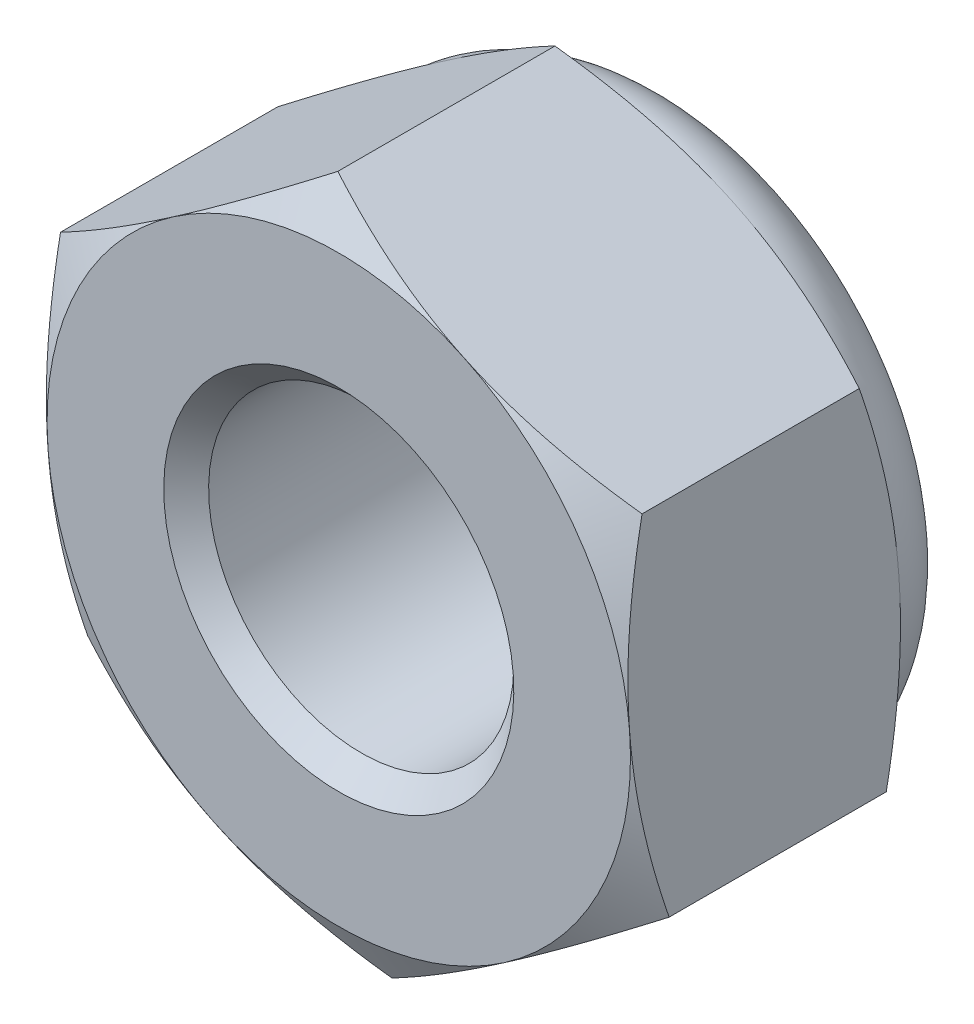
ISO-10303-21;
HEADER;
FILE_DESCRIPTION(('STEP AP214'),'2;1');
FILE_NAME('part.step','',(''),(''),'','','');
FILE_SCHEMA(('AUTOMOTIVE_DESIGN { 1 0 10303 214 1 1 1 1 }'));
ENDSEC;
DATA;
#1=APPLICATION_CONTEXT('core data for automotive mechanical design processes');
#2=APPLICATION_PROTOCOL_DEFINITION('international standard','automotive_design',2000,#1);
#3=PRODUCT_CONTEXT('',#1,'mechanical');
#4=PRODUCT('Part','Part','',(#3));
#5=PRODUCT_RELATED_PRODUCT_CATEGORY('part','',(#4));
#6=PRODUCT_DEFINITION_FORMATION('','',#4);
#7=PRODUCT_DEFINITION_CONTEXT('part definition',#1,'design');
#8=PRODUCT_DEFINITION('design','',#6,#7);
#9=PRODUCT_DEFINITION_SHAPE('','',#8);
#10=(LENGTH_UNIT() NAMED_UNIT(*) SI_UNIT(.MILLI.,.METRE.));
#11=(NAMED_UNIT(*) PLANE_ANGLE_UNIT() SI_UNIT($,.RADIAN.));
#12=(NAMED_UNIT(*) SI_UNIT($,.STERADIAN.) SOLID_ANGLE_UNIT());
#13=UNCERTAINTY_MEASURE_WITH_UNIT(LENGTH_MEASURE(1.E-05),#10,'distance_accuracy_value','');
#14=(GEOMETRIC_REPRESENTATION_CONTEXT(3) GLOBAL_UNCERTAINTY_ASSIGNED_CONTEXT((#13)) GLOBAL_UNIT_ASSIGNED_CONTEXT((#10,
#11,#12)) REPRESENTATION_CONTEXT('',''));
#15=CARTESIAN_POINT('',(0.,0.,0.));
#16=DIRECTION('',(0.,0.,1.));
#17=DIRECTION('',(1.,0.,0.));
#18=AXIS2_PLACEMENT_3D('',#15,#16,#17);
#19=CARTESIAN_POINT('',(725.474859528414,-0.667794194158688,-43.5));
#20=DIRECTION('',(-0.567885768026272,0.823107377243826,0.));
#21=DIRECTION('',(-0.823107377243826,-0.567885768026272,0.));
#22=AXIS2_PLACEMENT_3D('',#19,#20,#21);
#23=PLANE('',#22);
#24=DIRECTION('',(0.,0.,1.));
#25=VECTOR('',#24,1.);
#26=CARTESIAN_POINT('',(719.296983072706,-4.93009120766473,-43.5));
#27=LINE('',#26,#25);
#28=CARTESIAN_POINT('',(719.296983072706,-4.93009120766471,-42.9194434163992));
#29=VERTEX_POINT('',#28);
#30=CARTESIAN_POINT('',(719.296983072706,-4.93009120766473,-38.0805565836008));
#31=VERTEX_POINT('',#30);
#32=EDGE_CURVE('E175',#29,#31,#27,.T.);
#33=ORIENTED_EDGE('',*,*,#32,.T.);
#34=CARTESIAN_POINT('',(719.2967929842,-4.93022235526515,-38.0806232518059));
#35=CARTESIAN_POINT('',(719.432589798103,-4.8365321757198,-38.0330044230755));
#36=CARTESIAN_POINT('',(719.568892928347,-4.74249267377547,-37.9875467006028));
#37=CARTESIAN_POINT('',(719.842606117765,-4.55364996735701,-37.9015486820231));
#38=CARTESIAN_POINT('',(719.9800166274,-4.45884645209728,-37.8610105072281));
#39=CARTESIAN_POINT('',(720.394448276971,-4.17291797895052,-37.7475710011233));
#40=CARTESIAN_POINT('',(720.673105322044,-3.9806643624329,-37.6830478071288));
#41=CARTESIAN_POINT('',(721.090110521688,-3.69296032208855,-37.6073865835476));
#42=CARTESIAN_POINT('',(721.227212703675,-3.59836953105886,-37.5858328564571));
#43=CARTESIAN_POINT('',(721.502036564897,-3.4087605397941,-37.5496903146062));
#44=CARTESIAN_POINT('',(721.639758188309,-3.31374237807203,-37.5351008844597));
#45=CARTESIAN_POINT('',(721.915440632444,-3.12354102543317,-37.5132587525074));
#46=CARTESIAN_POINT('',(722.053401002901,-3.02835814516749,-37.5059977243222));
#47=CARTESIAN_POINT('',(722.329441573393,-2.83790971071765,-37.4989603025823));
#48=CARTESIAN_POINT('',(722.467521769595,-2.74264415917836,-37.4991836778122));
#49=CARTESIAN_POINT('',(722.845817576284,-2.48164685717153,-37.5100834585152));
#50=CARTESIAN_POINT('',(723.085909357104,-2.31600054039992,-37.5283818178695));
#51=CARTESIAN_POINT('',(723.564498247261,-1.9858081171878,-37.5864063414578));
#52=CARTESIAN_POINT('',(723.80299367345,-1.82126317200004,-37.6261523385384));
#53=CARTESIAN_POINT('',(724.282545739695,-1.49040622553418,-37.7255059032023));
#54=CARTESIAN_POINT('',(724.523541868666,-1.32413597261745,-37.7855344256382));
#55=CARTESIAN_POINT('',(725.001940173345,-0.994075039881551,-37.92177499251));
#56=CARTESIAN_POINT('',(725.239348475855,-0.830280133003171,-37.9979550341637));
#57=CARTESIAN_POINT('',(725.475049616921,-0.667663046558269,-38.0806232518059));
#58=B_SPLINE_CURVE_WITH_KNOTS('',3,(#34,#35,#36,#37,#38,#39,#40,#41,#42,#43,#44,#45,#46,#47,#48,
#49,#50,#51,#52,#53,#54,#55,#56,#57),.UNSPECIFIED.,.F.,.F.,(4,2,2,2,2,2,2,2,2,2,2,4),(0.,
0.51510505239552,1.03043143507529,2.06322554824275,2.56697389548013,3.07067772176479,
3.57380860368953,4.07692394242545,4.95279354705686,5.82947446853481,6.72559912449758,
7.61996451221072),.UNSPECIFIED.);
#59=CARTESIAN_POINT('',(722.38592130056,-2.79894270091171,-37.5));
#60=VERTEX_POINT('',#59);
#61=EDGE_CURVE('E39',#31,#60,#58,.T.);
#62=ORIENTED_EDGE('',*,*,#61,.T.);
#63=CARTESIAN_POINT('',(725.474859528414,-0.667794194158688,-38.0805565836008));
#64=VERTEX_POINT('',#63);
#65=EDGE_CURVE('E273',#60,#64,#58,.T.);
#66=ORIENTED_EDGE('',*,*,#65,.T.);
#67=DIRECTION('',(0.,0.,1.));
#68=VECTOR('',#67,1.);
#69=CARTESIAN_POINT('',(725.474859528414,-0.667794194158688,-43.5));
#70=LINE('',#69,#68);
#71=CARTESIAN_POINT('',(725.474859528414,-0.667794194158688,-42.9194434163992));
#72=VERTEX_POINT('',#71);
#73=EDGE_CURVE('E149',#72,#64,#70,.T.);
#74=ORIENTED_EDGE('',*,*,#73,.F.);
#75=CARTESIAN_POINT('',(719.2967929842,-4.93022235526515,-42.9193767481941));
#76=CARTESIAN_POINT('',(719.432589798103,-4.83653217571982,-42.9669955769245));
#77=CARTESIAN_POINT('',(719.568892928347,-4.74249267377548,-43.0124532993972));
#78=CARTESIAN_POINT('',(719.842606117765,-4.553649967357,-43.0984513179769));
#79=CARTESIAN_POINT('',(719.9800166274,-4.45884645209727,-43.1389894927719));
#80=CARTESIAN_POINT('',(720.394448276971,-4.1729179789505,-43.2524289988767));
#81=CARTESIAN_POINT('',(720.673105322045,-3.98066436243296,-43.3169521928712));
#82=CARTESIAN_POINT('',(721.090110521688,-3.69296032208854,-43.3926134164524));
#83=CARTESIAN_POINT('',(721.227212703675,-3.59836953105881,-43.4141671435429));
#84=CARTESIAN_POINT('',(721.502036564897,-3.40876053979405,-43.4503096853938));
#85=CARTESIAN_POINT('',(721.639758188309,-3.31374237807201,-43.4648991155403));
#86=CARTESIAN_POINT('',(721.915440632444,-3.12354102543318,-43.4867412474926));
#87=CARTESIAN_POINT('',(722.053401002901,-3.02835814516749,-43.4940022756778));
#88=CARTESIAN_POINT('',(722.329441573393,-2.83790971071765,-43.5010396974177));
#89=CARTESIAN_POINT('',(722.467521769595,-2.74264415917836,-43.5008163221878));
#90=CARTESIAN_POINT('',(722.845817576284,-2.48164685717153,-43.4899165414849));
#91=CARTESIAN_POINT('',(723.085909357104,-2.31600054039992,-43.4716181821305));
#92=CARTESIAN_POINT('',(723.564498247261,-1.9858081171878,-43.4135936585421));
#93=CARTESIAN_POINT('',(723.80299367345,-1.82126317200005,-43.3738476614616));
#94=CARTESIAN_POINT('',(724.282545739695,-1.49040622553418,-43.2744940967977));
#95=CARTESIAN_POINT('',(724.523541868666,-1.32413597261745,-43.2144655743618));
#96=CARTESIAN_POINT('',(725.001940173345,-0.994075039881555,-43.07822500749));
#97=CARTESIAN_POINT('',(725.239348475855,-0.830280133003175,-43.0020449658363));
#98=CARTESIAN_POINT('',(725.475049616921,-0.667663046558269,-42.9193767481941));
#99=B_SPLINE_CURVE_WITH_KNOTS('',3,(#75,#76,#77,#78,#79,#80,#81,#82,#83,#84,#85,#86,#87,#88,#89,
#90,#91,#92,#93,#94,#95,#96,#97,#98),.UNSPECIFIED.,.F.,.F.,(4,2,2,2,2,2,2,2,2,2,2,4),(0.,
0.515105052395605,1.03043143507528,2.06322554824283,2.56697389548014,3.07067772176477,
3.57380860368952,4.07692394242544,4.95279354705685,5.8294744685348,6.72559912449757,
7.61996451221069),.UNSPECIFIED.);
#100=CARTESIAN_POINT('',(722.38592130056,-2.79894270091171,-43.5));
#101=VERTEX_POINT('',#100);
#102=EDGE_CURVE('E177',#101,#72,#99,.T.);
#103=ORIENTED_EDGE('',*,*,#102,.F.);
#104=EDGE_CURVE('E182',#29,#101,#99,.T.);
#105=ORIENTED_EDGE('',*,*,#104,.F.);
#106=EDGE_LOOP('',(#33,#62,#66,#74,#103,#105));
#107=FACE_BOUND('',#106,.T.);
#108=ADVANCED_FACE('F16',(#107),#23,.T.);
#109=CARTESIAN_POINT('',(732.255055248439,-3.88684363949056,-43.5));
#110=DIRECTION('',(0.428889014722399,0.903357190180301,0.));
#111=DIRECTION('',(-0.903357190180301,0.428889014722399,0.));
#112=AXIS2_PLACEMENT_3D('',#109,#110,#111);
#113=PLANE('',#112);
#114=ORIENTED_EDGE('',*,*,#73,.T.);
#115=CARTESIAN_POINT('',(725.474650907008,-0.667695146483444,-38.0806232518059));
#116=CARTESIAN_POINT('',(725.623687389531,-0.738453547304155,-38.0330044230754));
#117=CARTESIAN_POINT('',(725.773279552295,-0.8094757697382,-37.9875467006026));
#118=CARTESIAN_POINT('',(726.073678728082,-0.952096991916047,-37.901548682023));
#119=CARTESIAN_POINT('',(726.224486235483,-1.023696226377,-37.861010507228));
#120=CARTESIAN_POINT('',(726.679323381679,-1.23964032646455,-37.7475710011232));
#121=CARTESIAN_POINT('',(726.985148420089,-1.3848375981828,-37.6830478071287));
#122=CARTESIAN_POINT('',(727.44281002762,-1.60212267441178,-37.6073865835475));
#123=CARTESIAN_POINT('',(727.59327914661,-1.67356125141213,-37.585832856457));
#124=CARTESIAN_POINT('',(727.894897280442,-1.81676120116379,-37.5496903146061));
#125=CARTESIAN_POINT('',(728.04604623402,-1.88852254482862,-37.5351008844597));
#126=CARTESIAN_POINT('',(728.348606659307,-2.03216986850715,-37.5132587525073));
#127=CARTESIAN_POINT('',(728.50001763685,-2.10405561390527,-37.5059977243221));
#128=CARTESIAN_POINT('',(728.802971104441,-2.24788954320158,-37.4989603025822));
#129=CARTESIAN_POINT('',(728.954513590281,-2.31983772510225,-37.4991836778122));
#130=CARTESIAN_POINT('',(729.369691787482,-2.51695285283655,-37.5100834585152));
#131=CARTESIAN_POINT('',(729.63319159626,-2.64205527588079,-37.5283818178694));
#132=CARTESIAN_POINT('',(730.158441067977,-2.89142920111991,-37.5864063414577));
#133=CARTESIAN_POINT('',(730.420188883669,-3.01569982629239,-37.6261523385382));
#134=CARTESIAN_POINT('',(730.946495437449,-3.26557562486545,-37.7255059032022));
#135=CARTESIAN_POINT('',(731.210987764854,-3.39114926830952,-37.785534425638));
#136=CARTESIAN_POINT('',(731.73602806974,-3.64042388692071,-37.9217749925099));
#137=CARTESIAN_POINT('',(731.996582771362,-3.76412805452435,-37.9979550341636));
#138=CARTESIAN_POINT('',(732.255263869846,-3.8869426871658,-38.0806232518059));
#139=B_SPLINE_CURVE_WITH_KNOTS('',3,(#115,#116,#117,#118,#119,#120,#121,#122,#123,#124,#125,
#126,#127,#128,#129,#130,#131,#132,#133,#134,#135,#136,#137,#138),.UNSPECIFIED.,.F.,.F.,(4,2,2,
2,2,2,2,2,2,2,2,4),(0.,0.515105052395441,1.03043143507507,2.0632255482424,2.56697389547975,
3.0706777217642,3.57380860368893,4.07692394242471,4.95279354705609,5.82947446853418,
6.72559912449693,7.61996451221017),.UNSPECIFIED.);
#140=CARTESIAN_POINT('',(728.864957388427,-2.27731891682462,-37.5));
#141=VERTEX_POINT('',#140);
#142=EDGE_CURVE('E279',#64,#141,#139,.T.);
#143=ORIENTED_EDGE('',*,*,#142,.T.);
#144=CARTESIAN_POINT('',(732.255055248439,-3.88684363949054,-38.0805565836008));
#145=VERTEX_POINT('',#144);
#146=EDGE_CURVE('E274',#141,#145,#139,.T.);
#147=ORIENTED_EDGE('',*,*,#146,.T.);
#148=DIRECTION('',(0.,0.,1.));
#149=VECTOR('',#148,1.);
#150=CARTESIAN_POINT('',(732.255055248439,-3.88684363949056,-43.5));
#151=LINE('',#150,#149);
#152=CARTESIAN_POINT('',(732.255055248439,-3.88684363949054,-42.9194434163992));
#153=VERTEX_POINT('',#152);
#154=EDGE_CURVE('E153',#153,#145,#151,.T.);
#155=ORIENTED_EDGE('',*,*,#154,.F.);
#156=CARTESIAN_POINT('',(725.474650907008,-0.667695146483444,-42.9193767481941));
#157=CARTESIAN_POINT('',(725.623687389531,-0.738453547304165,-42.9669955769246));
#158=CARTESIAN_POINT('',(725.773279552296,-0.809475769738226,-43.0124532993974));
#159=CARTESIAN_POINT('',(726.073678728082,-0.952096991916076,-43.0984513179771));
#160=CARTESIAN_POINT('',(726.224486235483,-1.02369622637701,-43.138989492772));
#161=CARTESIAN_POINT('',(726.679323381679,-1.23964032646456,-43.2524289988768));
#162=CARTESIAN_POINT('',(726.985148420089,-1.38483759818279,-43.3169521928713));
#163=CARTESIAN_POINT('',(727.44281002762,-1.60212267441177,-43.3926134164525));
#164=CARTESIAN_POINT('',(727.59327914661,-1.6735612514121,-43.414167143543));
#165=CARTESIAN_POINT('',(727.894897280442,-1.81676120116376,-43.4503096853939));
#166=CARTESIAN_POINT('',(728.04604623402,-1.8885225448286,-43.4648991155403));
#167=CARTESIAN_POINT('',(728.348606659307,-2.03216986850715,-43.4867412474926));
#168=CARTESIAN_POINT('',(728.50001763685,-2.10405561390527,-43.4940022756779));
#169=CARTESIAN_POINT('',(728.802971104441,-2.24788954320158,-43.5010396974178));
#170=CARTESIAN_POINT('',(728.954513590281,-2.31983772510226,-43.5008163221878));
#171=CARTESIAN_POINT('',(729.369691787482,-2.51695285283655,-43.4899165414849));
#172=CARTESIAN_POINT('',(729.63319159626,-2.64205527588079,-43.4716181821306));
#173=CARTESIAN_POINT('',(730.158441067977,-2.89142920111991,-43.4135936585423));
#174=CARTESIAN_POINT('',(730.420188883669,-3.01569982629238,-43.3738476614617));
#175=CARTESIAN_POINT('',(730.946495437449,-3.26557562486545,-43.2744940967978));
#176=CARTESIAN_POINT('',(731.210987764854,-3.39114926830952,-43.214465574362));
#177=CARTESIAN_POINT('',(731.73602806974,-3.64042388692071,-43.0782250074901));
#178=CARTESIAN_POINT('',(731.996582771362,-3.76412805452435,-43.0020449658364));
#179=CARTESIAN_POINT('',(732.255263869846,-3.8869426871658,-42.9193767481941));
#180=B_SPLINE_CURVE_WITH_KNOTS('',3,(#156,#157,#158,#159,#160,#161,#162,#163,#164,#165,#166,
#167,#168,#169,#170,#171,#172,#173,#174,#175,#176,#177,#178,#179),.UNSPECIFIED.,.F.,.F.,(4,2,2,
2,2,2,2,2,2,2,2,4),(0.,0.515105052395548,1.03043143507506,2.06322554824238,2.56697389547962,
3.07067772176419,3.57380860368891,4.0769239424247,4.95279354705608,5.82947446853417,
6.72559912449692,7.61996451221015),.UNSPECIFIED.);
#181=CARTESIAN_POINT('',(728.864957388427,-2.27731891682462,-43.5));
#182=VERTEX_POINT('',#181);
#183=EDGE_CURVE('E163',#182,#153,#180,.T.);
#184=ORIENTED_EDGE('',*,*,#183,.F.);
#185=EDGE_CURVE('E181',#72,#182,#180,.T.);
#186=ORIENTED_EDGE('',*,*,#185,.F.);
#187=EDGE_LOOP('',(#114,#143,#147,#155,#184,#186));
#188=FACE_BOUND('',#187,.T.);
#189=ADVANCED_FACE('F280',(#188),#113,.T.);
#190=CARTESIAN_POINT('',(732.255055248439,-3.88684363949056,-43.5));
#191=DIRECTION('',(-0.996774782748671,-0.0802498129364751,0.));
#192=DIRECTION('',(0.,0.,1.));
#193=AXIS2_PLACEMENT_3D('',#190,#191,#192);
#194=PLANE('',#193);
#195=CARTESIAN_POINT('',(733.35493460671,-17.5483335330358,-40.610423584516));
#196=CARTESIAN_POINT('',(733.332032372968,-17.2638672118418,-40.4725089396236));
#197=CARTESIAN_POINT('',(733.309075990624,-16.978728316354,-40.3359652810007));
#198=CARTESIAN_POINT('',(733.263025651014,-16.4067417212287,-40.0664033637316));
#199=CARTESIAN_POINT('',(733.239931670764,-16.1198937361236,-39.9333857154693));
#200=CARTESIAN_POINT('',(733.193452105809,-15.5425757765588,-39.6709585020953));
#201=CARTESIAN_POINT('',(733.170065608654,-15.2520944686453,-39.5415739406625));
#202=CARTESIAN_POINT('',(733.123100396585,-14.6687443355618,-39.2883622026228));
#203=CARTESIAN_POINT('',(733.099521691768,-14.3758756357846,-39.1645347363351));
#204=CARTESIAN_POINT('',(733.051841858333,-13.7836492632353,-38.9224448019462));
#205=CARTESIAN_POINT('',(733.027737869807,-13.4842560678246,-38.8042693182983));
#206=CARTESIAN_POINT('',(732.979245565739,-12.8819380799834,-38.5771738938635));
#207=CARTESIAN_POINT('',(732.954857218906,-12.5790128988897,-38.468254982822));
#208=CARTESIAN_POINT('',(732.905807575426,-11.9697722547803,-38.262599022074));
#209=CARTESIAN_POINT('',(732.881146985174,-11.6634655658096,-38.1658360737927));
#210=CARTESIAN_POINT('',(732.831474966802,-11.0464944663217,-37.9876357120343));
#211=CARTESIAN_POINT('',(732.806463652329,-10.7358314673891,-37.9061934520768));
#212=CARTESIAN_POINT('',(732.756074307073,-10.1099505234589,-37.7625840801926));
#213=CARTESIAN_POINT('',(732.730696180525,-9.79473138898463,-37.7004221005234));
#214=CARTESIAN_POINT('',(732.679630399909,-9.1604485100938,-37.599574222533));
#215=CARTESIAN_POINT('',(732.653942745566,-8.84138476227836,-37.5608883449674));
#216=CARTESIAN_POINT('',(732.615370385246,-8.36228138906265,-37.522946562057));
#217=CARTESIAN_POINT('',(732.602546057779,-8.20299171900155,-37.5136452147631));
#218=CARTESIAN_POINT('',(732.576876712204,-7.88415538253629,-37.5018140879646));
#219=CARTESIAN_POINT('',(732.564031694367,-7.72460871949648,-37.4992842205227));
#220=CARTESIAN_POINT('',(732.538348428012,-7.40559947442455,-37.5010640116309));
#221=CARTESIAN_POINT('',(732.525510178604,-7.24613688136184,-37.505371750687));
#222=CARTESIAN_POINT('',(732.499859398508,-6.927531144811,-37.5207175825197));
#223=CARTESIAN_POINT('',(732.487046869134,-6.76838801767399,-37.5317560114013));
#224=CARTESIAN_POINT('',(732.45599325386,-6.38267421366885,-37.566436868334));
#225=CARTESIAN_POINT('',(732.43777603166,-6.15639994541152,-37.5934518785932));
#226=CARTESIAN_POINT('',(732.401481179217,-5.70558526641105,-37.659589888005));
#227=CARTESIAN_POINT('',(732.383403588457,-5.48104534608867,-37.6987161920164));
#228=CARTESIAN_POINT('',(732.347402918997,-5.0338846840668,-37.7876891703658));
#229=CARTESIAN_POINT('',(732.32948000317,-4.81126596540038,-37.8375459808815));
#230=CARTESIAN_POINT('',(732.293818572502,-4.36831895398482,-37.9464587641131));
#231=CARTESIAN_POINT('',(732.276080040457,-4.14799044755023,-38.0055138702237));
#232=CARTESIAN_POINT('',(732.240350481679,-3.70419722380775,-38.1329541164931));
#233=CARTESIAN_POINT('',(732.222363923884,-3.48078801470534,-38.2015324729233));
#234=CARTESIAN_POINT('',(732.186580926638,-3.03633103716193,-38.3454651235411));
#235=CARTESIAN_POINT('',(732.168784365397,-2.81528175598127,-38.4208147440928));
#236=CARTESIAN_POINT('',(732.133452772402,-2.37643162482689,-38.5767335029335));
#237=CARTESIAN_POINT('',(732.115916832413,-2.15861949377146,-38.6572708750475));
#238=CARTESIAN_POINT('',(732.080981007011,-1.72468515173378,-38.8230727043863));
#239=CARTESIAN_POINT('',(732.063581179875,-1.50856366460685,-38.9083390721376));
#240=CARTESIAN_POINT('',(732.046244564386,-1.29322732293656,-38.9955021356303));
#241=B_SPLINE_CURVE_WITH_KNOTS('',3,(#195,#196,#197,#198,#199,#200,#201,#202,#203,#204,#205,
#206,#207,#208,#209,#210,#211,#212,#213,#214,#215,#216,#217,#218,#219,#220,#221,#222,#223,#224,
#225,#226,#227,#228,#229,#230,#231,#232,#233,#234,#235,#236,#237,#238,#239,#240),.UNSPECIFIED.,
.F.,.F.,(4,2,2,2,2,2,2,2,2,2,2,2,2,2,2,2,2,2,2,2,2,2,4),(0.,0.950904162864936,1.90197187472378,
2.85848216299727,3.81494253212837,4.78314526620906,5.75145556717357,6.71766655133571,
7.68357137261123,8.64973308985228,9.61589566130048,10.0960003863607,10.5760988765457,
11.0560626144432,11.5360503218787,12.2214931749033,12.9071232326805,13.59340381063,
14.2796197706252,14.982656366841,15.6852113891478,16.3838119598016,17.0826968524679),.UNSPECIFIED.);
#242=CARTESIAN_POINT('',(732.857374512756,-11.3681900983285,-38.0805565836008));
#243=VERTEX_POINT('',#242);
#244=CARTESIAN_POINT('',(732.556214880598,-7.62751686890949,-37.5));
#245=VERTEX_POINT('',#244);
#246=EDGE_CURVE('E263',#243,#245,#241,.T.);
#247=ORIENTED_EDGE('',*,*,#246,.F.);
#248=DIRECTION('',(0.,0.,1.));
#249=VECTOR('',#248,1.);
#250=CARTESIAN_POINT('',(732.857374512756,-11.3681900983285,-43.5));
#251=LINE('',#250,#249);
#252=CARTESIAN_POINT('',(732.857374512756,-11.3681900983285,-42.9194434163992));
#253=VERTEX_POINT('',#252);
#254=EDGE_CURVE('E160',#253,#243,#251,.T.);
#255=ORIENTED_EDGE('',*,*,#254,.F.);
#256=CARTESIAN_POINT('',(733.35493460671,-17.5483335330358,-40.389576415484));
#257=CARTESIAN_POINT('',(733.332032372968,-17.2638672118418,-40.5274910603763));
#258=CARTESIAN_POINT('',(733.309075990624,-16.978728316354,-40.6640347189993));
#259=CARTESIAN_POINT('',(733.263025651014,-16.4067417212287,-40.9335966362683));
#260=CARTESIAN_POINT('',(733.239931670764,-16.1198937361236,-41.0666142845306));
#261=CARTESIAN_POINT('',(733.193452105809,-15.5425757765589,-41.3290414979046));
#262=CARTESIAN_POINT('',(733.170065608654,-15.2520944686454,-41.4584260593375));
#263=CARTESIAN_POINT('',(733.123100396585,-14.6687443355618,-41.7116377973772));
#264=CARTESIAN_POINT('',(733.099521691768,-14.3758756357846,-41.8354652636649));
#265=CARTESIAN_POINT('',(733.051841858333,-13.7836492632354,-42.0775551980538));
#266=CARTESIAN_POINT('',(733.027737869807,-13.4842560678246,-42.1957306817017));
#267=CARTESIAN_POINT('',(732.979245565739,-12.8819380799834,-42.4228261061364));
#268=CARTESIAN_POINT('',(732.954857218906,-12.5790128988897,-42.531745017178));
#269=CARTESIAN_POINT('',(732.905807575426,-11.9697722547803,-42.737400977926));
#270=CARTESIAN_POINT('',(732.881146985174,-11.6634655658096,-42.8341639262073));
#271=CARTESIAN_POINT('',(732.831474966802,-11.0464944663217,-43.0123642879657));
#272=CARTESIAN_POINT('',(732.806463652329,-10.7358314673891,-43.0938065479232));
#273=CARTESIAN_POINT('',(732.756074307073,-10.1099505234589,-43.2374159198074));
#274=CARTESIAN_POINT('',(732.730696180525,-9.79473138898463,-43.2995778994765));
#275=CARTESIAN_POINT('',(732.679630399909,-9.1604485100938,-43.400425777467));
#276=CARTESIAN_POINT('',(732.653942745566,-8.84138476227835,-43.4391116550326));
#277=CARTESIAN_POINT('',(732.615370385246,-8.36228138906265,-43.477053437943));
#278=CARTESIAN_POINT('',(732.602546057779,-8.20299171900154,-43.4863547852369));
#279=CARTESIAN_POINT('',(732.576876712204,-7.88415538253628,-43.4981859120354));
#280=CARTESIAN_POINT('',(732.564031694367,-7.72460871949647,-43.5007157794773));
#281=CARTESIAN_POINT('',(732.538348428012,-7.40559947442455,-43.4989359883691));
#282=CARTESIAN_POINT('',(732.525510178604,-7.24613688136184,-43.494628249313));
#283=CARTESIAN_POINT('',(732.499859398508,-6.927531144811,-43.4792824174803));
#284=CARTESIAN_POINT('',(732.487046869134,-6.76838801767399,-43.4682439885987));
#285=CARTESIAN_POINT('',(732.45599325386,-6.38267421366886,-43.4335631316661));
#286=CARTESIAN_POINT('',(732.437776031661,-6.15639994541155,-43.4065481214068));
#287=CARTESIAN_POINT('',(732.401481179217,-5.70558526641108,-43.3404101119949));
#288=CARTESIAN_POINT('',(732.383403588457,-5.4810453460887,-43.3012838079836));
#289=CARTESIAN_POINT('',(732.347402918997,-5.03388468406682,-43.2123108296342));
#290=CARTESIAN_POINT('',(732.32948000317,-4.8112659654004,-43.1624540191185));
#291=CARTESIAN_POINT('',(732.293818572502,-4.36831895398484,-43.0535412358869));
#292=CARTESIAN_POINT('',(732.276080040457,-4.14799044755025,-42.9944861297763));
#293=CARTESIAN_POINT('',(732.240350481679,-3.70419722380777,-42.8670458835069));
#294=CARTESIAN_POINT('',(732.222363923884,-3.48078801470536,-42.7984675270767));
#295=CARTESIAN_POINT('',(732.186580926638,-3.03633103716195,-42.6545348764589));
#296=CARTESIAN_POINT('',(732.168784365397,-2.81528175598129,-42.5791852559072));
#297=CARTESIAN_POINT('',(732.133452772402,-2.3764316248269,-42.4232664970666));
#298=CARTESIAN_POINT('',(732.115916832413,-2.15861949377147,-42.3427291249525));
#299=CARTESIAN_POINT('',(732.080981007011,-1.72468515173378,-42.1769272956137));
#300=CARTESIAN_POINT('',(732.063581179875,-1.50856366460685,-42.0916609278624));
#301=CARTESIAN_POINT('',(732.046244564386,-1.29322732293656,-42.0044978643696));
#302=B_SPLINE_CURVE_WITH_KNOTS('',3,(#256,#257,#258,#259,#260,#261,#262,#263,#264,#265,#266,
#267,#268,#269,#270,#271,#272,#273,#274,#275,#276,#277,#278,#279,#280,#281,#282,#283,#284,#285,
#286,#287,#288,#289,#290,#291,#292,#293,#294,#295,#296,#297,#298,#299,#300,#301),.UNSPECIFIED.,
.F.,.F.,(4,2,2,2,2,2,2,2,2,2,2,2,2,2,2,2,2,2,2,2,2,2,4),(0.,0.950904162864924,1.90197187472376,
2.85848216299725,3.81494253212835,4.78314526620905,5.75145556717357,6.71766655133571,
7.68357137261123,8.64973308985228,9.61589566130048,10.0960003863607,10.5760988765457,
11.0560626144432,11.5360503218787,12.2214931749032,12.9071232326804,13.59340381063,
14.2796197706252,14.982656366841,15.6852113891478,16.3838119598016,17.0826968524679),.UNSPECIFIED.);
#303=CARTESIAN_POINT('',(732.556214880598,-7.62751686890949,-43.5));
#304=VERTEX_POINT('',#303);
#305=EDGE_CURVE('E134',#253,#304,#302,.T.);
#306=ORIENTED_EDGE('',*,*,#305,.T.);
#307=EDGE_CURVE('E189',#304,#153,#302,.T.);
#308=ORIENTED_EDGE('',*,*,#307,.T.);
#309=ORIENTED_EDGE('',*,*,#154,.T.);
#310=EDGE_CURVE('E268',#245,#145,#241,.T.);
#311=ORIENTED_EDGE('',*,*,#310,.F.);
#312=EDGE_LOOP('',(#247,#255,#306,#308,#309,#311));
#313=FACE_BOUND('',#312,.T.);
#314=ADVANCED_FACE('F202',(#313),#194,.F.);
#315=CARTESIAN_POINT('',(726.679498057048,-15.6304871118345,-43.5));
#316=DIRECTION('',(0.567885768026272,-0.823107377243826,0.));
#317=DIRECTION('',(0.823107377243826,0.567885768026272,0.));
#318=AXIS2_PLACEMENT_3D('',#315,#316,#317);
#319=PLANE('',#318);
#320=ORIENTED_EDGE('',*,*,#254,.T.);
#321=CARTESIAN_POINT('',(732.857564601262,-11.368058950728,-38.0806232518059));
#322=CARTESIAN_POINT('',(732.721767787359,-11.4617491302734,-38.0330044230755));
#323=CARTESIAN_POINT('',(732.585464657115,-11.5557886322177,-37.9875467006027));
#324=CARTESIAN_POINT('',(732.311751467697,-11.7446313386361,-37.9015486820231));
#325=CARTESIAN_POINT('',(732.174340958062,-11.8394348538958,-37.8610105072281));
#326=CARTESIAN_POINT('',(731.759909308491,-12.1253633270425,-37.7475710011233));
#327=CARTESIAN_POINT('',(731.481252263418,-12.3176169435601,-37.6830478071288));
#328=CARTESIAN_POINT('',(731.064247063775,-12.6053209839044,-37.6073865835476));
#329=CARTESIAN_POINT('',(730.927144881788,-12.699911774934,-37.5858328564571));
#330=CARTESIAN_POINT('',(730.652321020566,-12.8895207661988,-37.5496903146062));
#331=CARTESIAN_POINT('',(730.514599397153,-12.9845389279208,-37.5351008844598));
#332=CARTESIAN_POINT('',(730.238916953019,-13.1747402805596,-37.5132587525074));
#333=CARTESIAN_POINT('',(730.100956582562,-13.2699231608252,-37.5059977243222));
#334=CARTESIAN_POINT('',(729.82491601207,-13.4603715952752,-37.4989603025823));
#335=CARTESIAN_POINT('',(729.686835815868,-13.5556371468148,-37.4991836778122));
#336=CARTESIAN_POINT('',(729.308540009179,-13.8166344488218,-37.5100834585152));
#337=CARTESIAN_POINT('',(729.068448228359,-13.982280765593,-37.5283818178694));
#338=CARTESIAN_POINT('',(728.589859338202,-14.3124731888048,-37.5864063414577));
#339=CARTESIAN_POINT('',(728.351363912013,-14.4770181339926,-37.6261523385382));
#340=CARTESIAN_POINT('',(727.871811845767,-14.8078750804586,-37.7255059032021));
#341=CARTESIAN_POINT('',(727.630815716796,-14.9741453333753,-37.785534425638));
#342=CARTESIAN_POINT('',(727.152417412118,-15.3042062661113,-37.9217749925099));
#343=CARTESIAN_POINT('',(726.915009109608,-15.4680011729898,-37.9979550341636));
#344=CARTESIAN_POINT('',(726.679307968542,-15.630618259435,-38.0806232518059));
#345=B_SPLINE_CURVE_WITH_KNOTS('',3,(#321,#322,#323,#324,#325,#326,#327,#328,#329,#330,#331,
#332,#333,#334,#335,#336,#337,#338,#339,#340,#341,#342,#343,#344),.UNSPECIFIED.,.F.,.F.,(4,2,2,
2,2,2,2,2,2,2,2,4),(0.,0.515105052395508,1.03043143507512,2.06322554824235,2.5669738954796,
3.07067772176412,3.57380860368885,4.07692394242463,4.95279354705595,5.82947446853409,
6.72559912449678,7.61996451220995),.UNSPECIFIED.);
#346=CARTESIAN_POINT('',(729.768436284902,-13.4993386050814,-37.5));
#347=VERTEX_POINT('',#346);
#348=EDGE_CURVE('E262',#243,#347,#345,.T.);
#349=ORIENTED_EDGE('',*,*,#348,.T.);
#350=CARTESIAN_POINT('',(726.679498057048,-15.6304871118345,-38.0805565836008));
#351=VERTEX_POINT('',#350);
#352=EDGE_CURVE('E257',#347,#351,#345,.T.);
#353=ORIENTED_EDGE('',*,*,#352,.T.);
#354=DIRECTION('',(0.,0.,1.));
#355=VECTOR('',#354,1.);
#356=CARTESIAN_POINT('',(726.679498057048,-15.6304871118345,-43.5));
#357=LINE('',#356,#355);
#358=CARTESIAN_POINT('',(726.679498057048,-15.6304871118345,-42.9194434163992));
#359=VERTEX_POINT('',#358);
#360=EDGE_CURVE('E115',#359,#351,#357,.T.);
#361=ORIENTED_EDGE('',*,*,#360,.F.);
#362=CARTESIAN_POINT('',(732.857564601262,-11.368058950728,-42.9193767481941));
#363=CARTESIAN_POINT('',(732.721767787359,-11.4617491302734,-42.9669955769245));
#364=CARTESIAN_POINT('',(732.585464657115,-11.5557886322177,-43.0124532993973));
#365=CARTESIAN_POINT('',(732.311751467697,-11.7446313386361,-43.0984513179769));
#366=CARTESIAN_POINT('',(732.174340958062,-11.8394348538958,-43.1389894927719));
#367=CARTESIAN_POINT('',(731.759909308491,-12.1253633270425,-43.2524289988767));
#368=CARTESIAN_POINT('',(731.481252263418,-12.3176169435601,-43.3169521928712));
#369=CARTESIAN_POINT('',(731.064247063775,-12.6053209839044,-43.3926134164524));
#370=CARTESIAN_POINT('',(730.927144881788,-12.699911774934,-43.4141671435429));
#371=CARTESIAN_POINT('',(730.652321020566,-12.8895207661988,-43.4503096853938));
#372=CARTESIAN_POINT('',(730.514599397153,-12.9845389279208,-43.4648991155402));
#373=CARTESIAN_POINT('',(730.238916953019,-13.1747402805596,-43.4867412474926));
#374=CARTESIAN_POINT('',(730.100956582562,-13.2699231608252,-43.4940022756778));
#375=CARTESIAN_POINT('',(729.82491601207,-13.4603715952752,-43.5010396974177));
#376=CARTESIAN_POINT('',(729.686835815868,-13.5556371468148,-43.5008163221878));
#377=CARTESIAN_POINT('',(729.308540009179,-13.8166344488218,-43.4899165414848));
#378=CARTESIAN_POINT('',(729.068448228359,-13.982280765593,-43.4716181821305));
#379=CARTESIAN_POINT('',(728.589859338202,-14.3124731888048,-43.4135936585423));
#380=CARTESIAN_POINT('',(728.351363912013,-14.4770181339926,-43.3738476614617));
#381=CARTESIAN_POINT('',(727.871811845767,-14.8078750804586,-43.2744940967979));
#382=CARTESIAN_POINT('',(727.630815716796,-14.9741453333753,-43.214465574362));
#383=CARTESIAN_POINT('',(727.152417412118,-15.3042062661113,-43.0782250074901));
#384=CARTESIAN_POINT('',(726.915009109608,-15.4680011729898,-43.0020449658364));
#385=CARTESIAN_POINT('',(726.679307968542,-15.630618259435,-42.9193767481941));
#386=B_SPLINE_CURVE_WITH_KNOTS('',3,(#362,#363,#364,#365,#366,#367,#368,#369,#370,#371,#372,
#373,#374,#375,#376,#377,#378,#379,#380,#381,#382,#383,#384,#385),.UNSPECIFIED.,.F.,.F.,(4,2,2,
2,2,2,2,2,2,2,2,4),(0.,0.515105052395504,1.03043143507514,2.06322554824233,2.56697389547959,
3.07067772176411,3.57380860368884,4.07692394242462,4.95279354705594,5.82947446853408,
6.72559912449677,7.61996451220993),.UNSPECIFIED.);
#387=CARTESIAN_POINT('',(729.768436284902,-13.4993386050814,-43.5));
#388=VERTEX_POINT('',#387);
#389=EDGE_CURVE('E106',#388,#359,#386,.T.);
#390=ORIENTED_EDGE('',*,*,#389,.F.);
#391=EDGE_CURVE('E111',#253,#388,#386,.T.);
#392=ORIENTED_EDGE('',*,*,#391,.F.);
#393=EDGE_LOOP('',(#320,#349,#353,#361,#390,#392));
#394=FACE_BOUND('',#393,.T.);
#395=ADVANCED_FACE('F109',(#394),#319,.T.);
#396=CARTESIAN_POINT('',(719.899302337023,-12.4114376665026,-43.5));
#397=DIRECTION('',(-0.428889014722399,-0.903357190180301,0.));
#398=DIRECTION('',(0.903357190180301,-0.428889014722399,0.));
#399=AXIS2_PLACEMENT_3D('',#396,#397,#398);
#400=PLANE('',#399);
#401=ORIENTED_EDGE('',*,*,#360,.T.);
#402=CARTESIAN_POINT('',(726.679706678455,-15.6305861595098,-38.0806232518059));
#403=CARTESIAN_POINT('',(726.530670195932,-15.5598277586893,-38.0330044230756));
#404=CARTESIAN_POINT('',(726.381078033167,-15.4888055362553,-37.9875467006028));
#405=CARTESIAN_POINT('',(726.08067885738,-15.3461843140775,-37.9015486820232));
#406=CARTESIAN_POINT('',(725.92987134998,-15.2745850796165,-37.8610105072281));
#407=CARTESIAN_POINT('',(725.475034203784,-15.0586409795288,-37.7475710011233));
#408=CARTESIAN_POINT('',(725.169209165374,-14.9134437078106,-37.6830478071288));
#409=CARTESIAN_POINT('',(724.711547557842,-14.6961586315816,-37.6073865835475));
#410=CARTESIAN_POINT('',(724.561078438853,-14.6247200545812,-37.585832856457));
#411=CARTESIAN_POINT('',(724.259460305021,-14.4815201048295,-37.5496903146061));
#412=CARTESIAN_POINT('',(724.108311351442,-14.4097587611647,-37.5351008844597));
#413=CARTESIAN_POINT('',(723.805750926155,-14.2661114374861,-37.5132587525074));
#414=CARTESIAN_POINT('',(723.654339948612,-14.1942256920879,-37.5059977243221));
#415=CARTESIAN_POINT('',(723.351386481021,-14.0503917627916,-37.4989603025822));
#416=CARTESIAN_POINT('',(723.199843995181,-13.9784435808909,-37.4991836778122));
#417=CARTESIAN_POINT('',(722.78466579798,-13.7813284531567,-37.5100834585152));
#418=CARTESIAN_POINT('',(722.521165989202,-13.6562260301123,-37.5283818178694));
#419=CARTESIAN_POINT('',(721.995916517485,-13.4068521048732,-37.5864063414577));
#420=CARTESIAN_POINT('',(721.734168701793,-13.2825814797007,-37.6261523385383));
#421=CARTESIAN_POINT('',(721.207862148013,-13.0327056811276,-37.7255059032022));
#422=CARTESIAN_POINT('',(720.943369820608,-12.9071320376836,-37.7855344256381));
#423=CARTESIAN_POINT('',(720.418329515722,-12.6578574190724,-37.9217749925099));
#424=CARTESIAN_POINT('',(720.1577748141,-12.5341532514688,-37.9979550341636));
#425=CARTESIAN_POINT('',(719.899093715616,-12.4113386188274,-38.0806232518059));
#426=B_SPLINE_CURVE_WITH_KNOTS('',3,(#402,#403,#404,#405,#406,#407,#408,#409,#410,#411,#412,
#413,#414,#415,#416,#417,#418,#419,#420,#421,#422,#423,#424,#425),.UNSPECIFIED.,.F.,.F.,(4,2,2,
2,2,2,2,2,2,2,2,4),(0.,0.515105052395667,1.03043143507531,2.0632255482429,2.56697389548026,
3.07067772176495,3.5738086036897,4.07692394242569,4.95279354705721,5.8294744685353,
6.72559912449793,7.61996451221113),.UNSPECIFIED.);
#427=CARTESIAN_POINT('',(723.289400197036,-14.0209623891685,-37.5));
#428=VERTEX_POINT('',#427);
#429=EDGE_CURVE('E250',#351,#428,#426,.T.);
#430=ORIENTED_EDGE('',*,*,#429,.T.);
#431=CARTESIAN_POINT('',(719.899302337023,-12.4114376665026,-38.0805565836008));
#432=VERTEX_POINT('',#431);
#433=EDGE_CURVE('E243',#428,#432,#426,.T.);
#434=ORIENTED_EDGE('',*,*,#433,.T.);
#435=DIRECTION('',(0.,0.,1.));
#436=VECTOR('',#435,1.);
#437=CARTESIAN_POINT('',(719.899302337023,-12.4114376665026,-43.5));
#438=LINE('',#437,#436);
#439=CARTESIAN_POINT('',(719.899302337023,-12.4114376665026,-42.9194434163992));
#440=VERTEX_POINT('',#439);
#441=EDGE_CURVE('E173',#440,#432,#438,.T.);
#442=ORIENTED_EDGE('',*,*,#441,.F.);
#443=CARTESIAN_POINT('',(726.679706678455,-15.6305861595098,-42.9193767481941));
#444=CARTESIAN_POINT('',(726.530670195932,-15.5598277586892,-42.9669955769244));
#445=CARTESIAN_POINT('',(726.381078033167,-15.4888055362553,-43.0124532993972));
#446=CARTESIAN_POINT('',(726.08067885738,-15.3461843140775,-43.0984513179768));
#447=CARTESIAN_POINT('',(725.92987134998,-15.2745850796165,-43.1389894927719));
#448=CARTESIAN_POINT('',(725.475034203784,-15.0586409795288,-43.2524289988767));
#449=CARTESIAN_POINT('',(725.169209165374,-14.9134437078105,-43.3169521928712));
#450=CARTESIAN_POINT('',(724.711547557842,-14.6961586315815,-43.3926134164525));
#451=CARTESIAN_POINT('',(724.561078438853,-14.6247200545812,-43.414167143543));
#452=CARTESIAN_POINT('',(724.259460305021,-14.4815201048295,-43.4503096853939));
#453=CARTESIAN_POINT('',(724.108311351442,-14.4097587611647,-43.4648991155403));
#454=CARTESIAN_POINT('',(723.805750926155,-14.2661114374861,-43.4867412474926));
#455=CARTESIAN_POINT('',(723.654339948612,-14.1942256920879,-43.4940022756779));
#456=CARTESIAN_POINT('',(723.351386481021,-14.0503917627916,-43.5010396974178));
#457=CARTESIAN_POINT('',(723.199843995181,-13.9784435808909,-43.5008163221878));
#458=CARTESIAN_POINT('',(722.78466579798,-13.7813284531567,-43.4899165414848));
#459=CARTESIAN_POINT('',(722.521165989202,-13.6562260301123,-43.4716181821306));
#460=CARTESIAN_POINT('',(721.995916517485,-13.4068521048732,-43.4135936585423));
#461=CARTESIAN_POINT('',(721.734168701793,-13.2825814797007,-43.3738476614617));
#462=CARTESIAN_POINT('',(721.207862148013,-13.0327056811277,-43.2744940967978));
#463=CARTESIAN_POINT('',(720.943369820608,-12.9071320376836,-43.2144655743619));
#464=CARTESIAN_POINT('',(720.418329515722,-12.6578574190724,-43.0782250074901));
#465=CARTESIAN_POINT('',(720.1577748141,-12.5341532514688,-43.0020449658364));
#466=CARTESIAN_POINT('',(719.899093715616,-12.4113386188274,-42.9193767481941));
#467=B_SPLINE_CURVE_WITH_KNOTS('',3,(#443,#444,#445,#446,#447,#448,#449,#450,#451,#452,#453,
#454,#455,#456,#457,#458,#459,#460,#461,#462,#463,#464,#465,#466),.UNSPECIFIED.,.F.,.F.,(4,2,2,
2,2,2,2,2,2,2,2,4),(0.,0.515105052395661,1.03043143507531,2.06322554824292,2.56697389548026,
3.07067772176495,3.5738086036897,4.07692394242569,4.95279354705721,5.8294744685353,
6.72559912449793,7.61996451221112),.UNSPECIFIED.);
#468=CARTESIAN_POINT('',(723.289400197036,-14.0209623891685,-43.5));
#469=VERTEX_POINT('',#468);
#470=EDGE_CURVE('E227',#469,#440,#467,.T.);
#471=ORIENTED_EDGE('',*,*,#470,.F.);
#472=EDGE_CURVE('E119',#359,#469,#467,.T.);
#473=ORIENTED_EDGE('',*,*,#472,.F.);
#474=EDGE_LOOP('',(#401,#430,#434,#442,#471,#473));
#475=FACE_BOUND('',#474,.T.);
#476=ADVANCED_FACE('F234',(#475),#400,.T.);
#477=CARTESIAN_POINT('',(719.296983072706,-4.93009120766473,-43.5));
#478=DIRECTION('',(-0.996774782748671,-0.0802498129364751,0.));
#479=DIRECTION('',(0.,0.,1.));
#480=AXIS2_PLACEMENT_3D('',#477,#478,#479);
#481=PLANE('',#480);
#482=ORIENTED_EDGE('',*,*,#441,.T.);
#483=CARTESIAN_POINT('',(720.396862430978,-18.59158110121,-40.610423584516));
#484=CARTESIAN_POINT('',(720.373960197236,-18.307114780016,-40.4725089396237));
#485=CARTESIAN_POINT('',(720.351003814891,-18.0219758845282,-40.3359652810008));
#486=CARTESIAN_POINT('',(720.30495347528,-17.449989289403,-40.0664033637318));
#487=CARTESIAN_POINT('',(720.281859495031,-17.1631413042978,-39.9333857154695));
#488=CARTESIAN_POINT('',(720.235379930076,-16.5858233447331,-39.6709585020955));
#489=CARTESIAN_POINT('',(720.211993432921,-16.2953420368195,-39.5415739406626));
#490=CARTESIAN_POINT('',(720.165028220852,-15.711991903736,-39.2883622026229));
#491=CARTESIAN_POINT('',(720.141449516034,-15.4191232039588,-39.1645347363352));
#492=CARTESIAN_POINT('',(720.0937696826,-14.8268968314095,-38.9224448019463));
#493=CARTESIAN_POINT('',(720.069665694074,-14.5275036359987,-38.8042693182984));
#494=CARTESIAN_POINT('',(720.021173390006,-13.9251856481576,-38.5771738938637));
#495=CARTESIAN_POINT('',(719.996785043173,-13.6222604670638,-38.4682549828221));
#496=CARTESIAN_POINT('',(719.947735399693,-13.0130198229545,-38.2625990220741));
#497=CARTESIAN_POINT('',(719.923074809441,-12.7067131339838,-38.1658360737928));
#498=CARTESIAN_POINT('',(719.873402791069,-12.0897420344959,-37.9876357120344));
#499=CARTESIAN_POINT('',(719.848391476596,-11.7790790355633,-37.9061934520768));
#500=CARTESIAN_POINT('',(719.798002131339,-11.1531980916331,-37.7625840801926));
#501=CARTESIAN_POINT('',(719.772624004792,-10.8379789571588,-37.7004221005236));
#502=CARTESIAN_POINT('',(719.721558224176,-10.2036960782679,-37.5995742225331));
#503=CARTESIAN_POINT('',(719.695870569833,-9.88463233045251,-37.5608883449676));
#504=CARTESIAN_POINT('',(719.657298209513,-9.40552895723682,-37.5229465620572));
#505=CARTESIAN_POINT('',(719.644473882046,-9.24623928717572,-37.5136452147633));
#506=CARTESIAN_POINT('',(719.618804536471,-8.92740295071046,-37.5018140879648));
#507=CARTESIAN_POINT('',(719.605959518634,-8.76785628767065,-37.4992842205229));
#508=CARTESIAN_POINT('',(719.580276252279,-8.44884704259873,-37.501064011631));
#509=CARTESIAN_POINT('',(719.567438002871,-8.28938444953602,-37.5053717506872));
#510=CARTESIAN_POINT('',(719.541787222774,-7.97077871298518,-37.5207175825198));
#511=CARTESIAN_POINT('',(719.528974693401,-7.81163558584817,-37.5317560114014));
#512=CARTESIAN_POINT('',(719.497921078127,-7.42592178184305,-37.5664368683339));
#513=CARTESIAN_POINT('',(719.479703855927,-7.19964751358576,-37.5934518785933));
#514=CARTESIAN_POINT('',(719.443409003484,-6.74883283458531,-37.6595898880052));
#515=CARTESIAN_POINT('',(719.425331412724,-6.52429291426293,-37.6987161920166));
#516=CARTESIAN_POINT('',(719.389330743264,-6.07713225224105,-37.7876891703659));
#517=CARTESIAN_POINT('',(719.371407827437,-5.85451353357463,-37.8375459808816));
#518=CARTESIAN_POINT('',(719.335746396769,-5.41156652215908,-37.9464587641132));
#519=CARTESIAN_POINT('',(719.318007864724,-5.19123801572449,-38.0055138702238));
#520=CARTESIAN_POINT('',(719.282278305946,-4.74744479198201,-38.1329541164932));
#521=CARTESIAN_POINT('',(719.264291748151,-4.5240355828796,-38.2015324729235));
#522=CARTESIAN_POINT('',(719.228508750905,-4.07957860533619,-38.3454651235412));
#523=CARTESIAN_POINT('',(719.210712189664,-3.85852932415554,-38.4208147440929));
#524=CARTESIAN_POINT('',(719.175380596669,-3.41967919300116,-38.5767335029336));
#525=CARTESIAN_POINT('',(719.15784465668,-3.20186706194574,-38.6572708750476));
#526=CARTESIAN_POINT('',(719.122908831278,-2.76793271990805,-38.8230727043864));
#527=CARTESIAN_POINT('',(719.105509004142,-2.55181123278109,-38.9083390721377));
#528=CARTESIAN_POINT('',(719.088172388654,-2.33647489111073,-38.9955021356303));
#529=B_SPLINE_CURVE_WITH_KNOTS('',3,(#483,#484,#485,#486,#487,#488,#489,#490,#491,#492,#493,
#494,#495,#496,#497,#498,#499,#500,#501,#502,#503,#504,#505,#506,#507,#508,#509,#510,#511,#512,
#513,#514,#515,#516,#517,#518,#519,#520,#521,#522,#523,#524,#525,#526,#527,#528),.UNSPECIFIED.,
.F.,.F.,(4,2,2,2,2,2,2,2,2,2,2,2,2,2,2,2,2,2,2,2,2,2,4),(0.,0.950904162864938,1.90197187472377,
2.85848216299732,3.81494253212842,4.78314526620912,5.75145556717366,6.71766655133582,
7.68357137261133,8.64973308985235,9.61589566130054,10.0960003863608,10.5760988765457,
11.0560626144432,11.5360503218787,12.2214931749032,12.9071232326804,13.59340381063,
14.2796197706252,14.982656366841,15.6852113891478,16.3838119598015,17.0826968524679),.UNSPECIFIED.);
#530=CARTESIAN_POINT('',(719.598142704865,-8.67076443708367,-37.5));
#531=VERTEX_POINT('',#530);
#532=EDGE_CURVE('E251',#432,#531,#529,.T.);
#533=ORIENTED_EDGE('',*,*,#532,.T.);
#534=EDGE_CURVE('E252',#531,#31,#529,.T.);
#535=ORIENTED_EDGE('',*,*,#534,.T.);
#536=ORIENTED_EDGE('',*,*,#32,.F.);
#537=CARTESIAN_POINT('',(720.396862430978,-18.59158110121,-40.389576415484));
#538=CARTESIAN_POINT('',(720.373960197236,-18.307114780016,-40.5274910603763));
#539=CARTESIAN_POINT('',(720.351003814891,-18.0219758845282,-40.6640347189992));
#540=CARTESIAN_POINT('',(720.30495347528,-17.449989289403,-40.9335966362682));
#541=CARTESIAN_POINT('',(720.281859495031,-17.1631413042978,-41.0666142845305));
#542=CARTESIAN_POINT('',(720.235379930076,-16.5858233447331,-41.3290414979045));
#543=CARTESIAN_POINT('',(720.211993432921,-16.2953420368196,-41.4584260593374));
#544=CARTESIAN_POINT('',(720.165028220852,-15.711991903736,-41.711637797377));
#545=CARTESIAN_POINT('',(720.141449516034,-15.4191232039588,-41.8354652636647));
#546=CARTESIAN_POINT('',(720.0937696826,-14.8268968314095,-42.0775551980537));
#547=CARTESIAN_POINT('',(720.069665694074,-14.5275036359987,-42.1957306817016));
#548=CARTESIAN_POINT('',(720.021173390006,-13.9251856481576,-42.4228261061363));
#549=CARTESIAN_POINT('',(719.996785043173,-13.6222604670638,-42.5317450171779));
#550=CARTESIAN_POINT('',(719.947735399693,-13.0130198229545,-42.7374009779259));
#551=CARTESIAN_POINT('',(719.923074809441,-12.7067131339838,-42.8341639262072));
#552=CARTESIAN_POINT('',(719.873402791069,-12.0897420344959,-43.0123642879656));
#553=CARTESIAN_POINT('',(719.848391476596,-11.7790790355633,-43.0938065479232));
#554=CARTESIAN_POINT('',(719.798002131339,-11.1531980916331,-43.2374159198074));
#555=CARTESIAN_POINT('',(719.772624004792,-10.8379789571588,-43.2995778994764));
#556=CARTESIAN_POINT('',(719.721558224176,-10.2036960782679,-43.4004257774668));
#557=CARTESIAN_POINT('',(719.695870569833,-9.88463233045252,-43.4391116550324));
#558=CARTESIAN_POINT('',(719.657298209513,-9.40552895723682,-43.4770534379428));
#559=CARTESIAN_POINT('',(719.644473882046,-9.24623928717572,-43.4863547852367));
#560=CARTESIAN_POINT('',(719.618804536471,-8.92740295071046,-43.4981859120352));
#561=CARTESIAN_POINT('',(719.605959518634,-8.76785628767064,-43.5007157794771));
#562=CARTESIAN_POINT('',(719.580276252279,-8.44884704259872,-43.498935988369));
#563=CARTESIAN_POINT('',(719.567438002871,-8.28938444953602,-43.4946282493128));
#564=CARTESIAN_POINT('',(719.541787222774,-7.97077871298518,-43.4792824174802));
#565=CARTESIAN_POINT('',(719.528974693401,-7.81163558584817,-43.4682439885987));
#566=CARTESIAN_POINT('',(719.497921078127,-7.42592178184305,-43.4335631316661));
#567=CARTESIAN_POINT('',(719.479703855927,-7.19964751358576,-43.4065481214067));
#568=CARTESIAN_POINT('',(719.443409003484,-6.74883283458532,-43.3404101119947));
#569=CARTESIAN_POINT('',(719.425331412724,-6.52429291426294,-43.3012838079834));
#570=CARTESIAN_POINT('',(719.389330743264,-6.07713225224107,-43.2123108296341));
#571=CARTESIAN_POINT('',(719.371407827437,-5.85451353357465,-43.1624540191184));
#572=CARTESIAN_POINT('',(719.335746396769,-5.4115665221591,-43.0535412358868));
#573=CARTESIAN_POINT('',(719.318007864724,-5.19123801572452,-42.9944861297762));
#574=CARTESIAN_POINT('',(719.282278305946,-4.74744479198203,-42.8670458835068));
#575=CARTESIAN_POINT('',(719.264291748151,-4.52403558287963,-42.7984675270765));
#576=CARTESIAN_POINT('',(719.228508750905,-4.0795786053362,-42.6545348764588));
#577=CARTESIAN_POINT('',(719.210712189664,-3.85852932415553,-42.5791852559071));
#578=CARTESIAN_POINT('',(719.175380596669,-3.41967919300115,-42.4232664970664));
#579=CARTESIAN_POINT('',(719.15784465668,-3.20186706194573,-42.3427291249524));
#580=CARTESIAN_POINT('',(719.122908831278,-2.76793271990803,-42.1769272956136));
#581=CARTESIAN_POINT('',(719.105509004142,-2.55181123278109,-42.0916609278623));
#582=CARTESIAN_POINT('',(719.088172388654,-2.33647489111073,-42.0044978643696));
#583=B_SPLINE_CURVE_WITH_KNOTS('',3,(#537,#538,#539,#540,#541,#542,#543,#544,#545,#546,#547,
#548,#549,#550,#551,#552,#553,#554,#555,#556,#557,#558,#559,#560,#561,#562,#563,#564,#565,#566,
#567,#568,#569,#570,#571,#572,#573,#574,#575,#576,#577,#578,#579,#580,#581,#582),.UNSPECIFIED.,
.F.,.F.,(4,2,2,2,2,2,2,2,2,2,2,2,2,2,2,2,2,2,2,2,2,2,4),(0.,0.950904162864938,1.90197187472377,
2.8584821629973,3.8149425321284,4.78314526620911,5.75145556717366,6.71766655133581,
7.68357137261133,8.64973308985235,9.61589566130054,10.0960003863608,10.5760988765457,
11.0560626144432,11.5360503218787,12.2214931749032,12.9071232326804,13.59340381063,
14.2796197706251,14.982656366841,15.6852113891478,16.3838119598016,17.0826968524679),.UNSPECIFIED.);
#584=CARTESIAN_POINT('',(719.598142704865,-8.67076443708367,-43.5));
#585=VERTEX_POINT('',#584);
#586=EDGE_CURVE('E220',#585,#29,#583,.T.);
#587=ORIENTED_EDGE('',*,*,#586,.F.);
#588=EDGE_CURVE('E233',#440,#585,#583,.T.);
#589=ORIENTED_EDGE('',*,*,#588,.F.);
#590=EDGE_LOOP('',(#482,#533,#535,#536,#587,#589));
#591=FACE_BOUND('',#590,.T.);
#592=ADVANCED_FACE('F237',(#591),#481,.T.);
#593=CARTESIAN_POINT('',(713.119106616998,-9.19238822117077,-37.5));
#594=DIRECTION('',(0.,0.,1.));
#595=DIRECTION('',(0.996774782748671,0.0802498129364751,0.));
#596=AXIS2_PLACEMENT_3D('',#593,#594,#595);
#597=PLANE('',#596);
#598=CARTESIAN_POINT('',(726.077178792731,-8.14914065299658,-37.5));
#599=DIRECTION('',(0.,0.,1.));
#600=DIRECTION('',(0.996774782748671,0.0802498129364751,0.));
#601=AXIS2_PLACEMENT_3D('',#598,#599,#600);
#602=CIRCLE('',#601,3.9);
#603=CARTESIAN_POINT('',(729.964600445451,-7.83616638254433,-37.5));
#604=VERTEX_POINT('',#603);
#605=EDGE_CURVE('E24',#604,#604,#602,.F.);
#606=ORIENTED_EDGE('',*,*,#605,.T.);
#607=EDGE_LOOP('',(#606));
#608=FACE_BOUND('',#607,.T.);
#609=CARTESIAN_POINT('',(726.077178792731,-8.14914065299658,-37.5));
#610=DIRECTION('',(0.,0.,1.));
#611=DIRECTION('',(0.996774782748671,0.0802498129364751,0.));
#612=AXIS2_PLACEMENT_3D('',#609,#610,#611);
#613=CIRCLE('',#612,6.5);
#614=EDGE_CURVE('E141',#347,#245,#613,.T.);
#615=ORIENTED_EDGE('',*,*,#614,.T.);
#616=CARTESIAN_POINT('',(726.077178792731,-8.14914065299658,-37.5));
#617=DIRECTION('',(0.,0.,1.));
#618=DIRECTION('',(0.996774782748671,0.0802498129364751,0.));
#619=AXIS2_PLACEMENT_3D('',#616,#617,#618);
#620=CIRCLE('',#619,6.5);
#621=EDGE_CURVE('E31',#245,#141,#620,.T.);
#622=ORIENTED_EDGE('',*,*,#621,.T.);
#623=EDGE_CURVE('E146',#141,#60,#613,.T.);
#624=ORIENTED_EDGE('',*,*,#623,.T.);
#625=EDGE_CURVE('E497',#60,#531,#613,.T.);
#626=ORIENTED_EDGE('',*,*,#625,.T.);
#627=EDGE_CURVE('E500',#531,#428,#613,.T.);
#628=ORIENTED_EDGE('',*,*,#627,.T.);
#629=EDGE_CURVE('E144',#428,#347,#613,.T.);
#630=ORIENTED_EDGE('',*,*,#629,.T.);
#631=EDGE_LOOP('',(#615,#622,#624,#626,#628,#630));
#632=FACE_BOUND('',#631,.T.);
#633=ADVANCED_FACE('F283',(#608,#632),#597,.T.);
#634=CARTESIAN_POINT('',(726.077178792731,-8.14914065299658,-43.5));
#635=DIRECTION('',(0.,0.,1.));
#636=DIRECTION('',(0.996774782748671,0.0802498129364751,0.));
#637=AXIS2_PLACEMENT_3D('',#634,#635,#636);
#638=CYLINDRICAL_SURFACE('',#637,3.4);
#639=CARTESIAN_POINT('',(726.077178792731,-8.14914065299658,-38.));
#640=DIRECTION('',(0.,0.,1.));
#641=DIRECTION('',(0.996774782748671,0.0802498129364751,0.));
#642=AXIS2_PLACEMENT_3D('',#639,#640,#641);
#643=CIRCLE('',#642,3.4);
#644=CARTESIAN_POINT('',(729.466213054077,-7.87629128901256,-38.));
#645=VERTEX_POINT('',#644);
#646=EDGE_CURVE('E484',#645,#645,#643,.T.);
#647=ORIENTED_EDGE('',*,*,#646,.T.);
#648=EDGE_LOOP('',(#647));
#649=FACE_BOUND('',#648,.T.);
#650=CARTESIAN_POINT('',(726.077178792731,-8.14914065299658,-44.5));
#651=DIRECTION('',(0.,0.,-1.));
#652=DIRECTION('',(-0.996774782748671,-0.0802498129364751,0.));
#653=AXIS2_PLACEMENT_3D('',#650,#651,#652);
#654=CIRCLE('',#653,3.4);
#655=CARTESIAN_POINT('',(722.688144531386,-8.42199001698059,-44.5));
#656=VERTEX_POINT('',#655);
#657=EDGE_CURVE('E482',#656,#656,#654,.T.);
#658=ORIENTED_EDGE('',*,*,#657,.T.);
#659=EDGE_LOOP('',(#658));
#660=FACE_BOUND('',#659,.T.);
#661=ADVANCED_FACE('F215',(#649,#660),#638,.F.);
#662=CARTESIAN_POINT('',(726.077178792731,-8.14914065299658,-43.5));
#663=DIRECTION('',(0.,0.,1.));
#664=DIRECTION('',(0.996774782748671,0.0802498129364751,0.));
#665=AXIS2_PLACEMENT_3D('',#662,#663,#664);
#666=CONICAL_SURFACE('',#665,6.5,1.0471975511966);
#667=ORIENTED_EDGE('',*,*,#183,.T.);
#668=ORIENTED_EDGE('',*,*,#307,.F.);
#669=CARTESIAN_POINT('',(726.077178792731,-8.14914065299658,-43.5));
#670=DIRECTION('',(0.,0.,1.));
#671=DIRECTION('',(0.996774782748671,0.0802498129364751,0.));
#672=AXIS2_PLACEMENT_3D('',#669,#670,#671);
#673=CIRCLE('',#672,6.5);
#674=EDGE_CURVE('E140',#304,#182,#673,.T.);
#675=ORIENTED_EDGE('',*,*,#674,.T.);
#676=EDGE_LOOP('',(#667,#668,#675));
#677=FACE_BOUND('',#676,.T.);
#678=ADVANCED_FACE('F292',(#677),#666,.T.);
#679=ORIENTED_EDGE('',*,*,#102,.T.);
#680=ORIENTED_EDGE('',*,*,#185,.T.);
#681=CARTESIAN_POINT('',(726.077178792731,-8.14914065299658,-43.5));
#682=DIRECTION('',(0.,0.,1.));
#683=DIRECTION('',(0.996774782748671,0.0802498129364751,0.));
#684=AXIS2_PLACEMENT_3D('',#681,#682,#683);
#685=CIRCLE('',#684,6.5);
#686=EDGE_CURVE('E142',#101,#182,#685,.F.);
#687=ORIENTED_EDGE('',*,*,#686,.F.);
#688=EDGE_LOOP('',(#679,#680,#687));
#689=FACE_BOUND('',#688,.T.);
#690=ADVANCED_FACE('F211',(#689),#666,.T.);
#691=ORIENTED_EDGE('',*,*,#104,.T.);
#692=EDGE_CURVE('E148',#585,#101,#685,.F.);
#693=ORIENTED_EDGE('',*,*,#692,.F.);
#694=ORIENTED_EDGE('',*,*,#586,.T.);
#695=EDGE_LOOP('',(#691,#693,#694));
#696=FACE_BOUND('',#695,.T.);
#697=ADVANCED_FACE('F209',(#696),#666,.T.);
#698=ORIENTED_EDGE('',*,*,#470,.T.);
#699=ORIENTED_EDGE('',*,*,#588,.T.);
#700=EDGE_CURVE('E128',#469,#585,#685,.F.);
#701=ORIENTED_EDGE('',*,*,#700,.F.);
#702=EDGE_LOOP('',(#698,#699,#701));
#703=FACE_BOUND('',#702,.T.);
#704=ADVANCED_FACE('F204',(#703),#666,.T.);
#705=ORIENTED_EDGE('',*,*,#389,.T.);
#706=ORIENTED_EDGE('',*,*,#472,.T.);
#707=EDGE_CURVE('E121',#388,#469,#685,.F.);
#708=ORIENTED_EDGE('',*,*,#707,.F.);
#709=EDGE_LOOP('',(#705,#706,#708));
#710=FACE_BOUND('',#709,.T.);
#711=ADVANCED_FACE('F122',(#710),#666,.T.);
#712=ORIENTED_EDGE('',*,*,#391,.T.);
#713=EDGE_CURVE('E127',#304,#388,#685,.F.);
#714=ORIENTED_EDGE('',*,*,#713,.F.);
#715=ORIENTED_EDGE('',*,*,#305,.F.);
#716=EDGE_LOOP('',(#712,#714,#715));
#717=FACE_BOUND('',#716,.T.);
#718=ADVANCED_FACE('F131',(#717),#666,.T.);
#719=CARTESIAN_POINT('',(726.077178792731,-8.14914065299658,-37.5));
#720=DIRECTION('',(0.,0.,-1.));
#721=DIRECTION('',(-0.996774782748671,-0.0802498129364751,0.));
#722=AXIS2_PLACEMENT_3D('',#719,#720,#721);
#723=CONICAL_SURFACE('',#722,6.5,1.0471975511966);
#724=ORIENTED_EDGE('',*,*,#246,.T.);
#725=ORIENTED_EDGE('',*,*,#614,.F.);
#726=ORIENTED_EDGE('',*,*,#348,.F.);
#727=EDGE_LOOP('',(#724,#725,#726));
#728=FACE_BOUND('',#727,.T.);
#729=ADVANCED_FACE('F387',(#728),#723,.T.);
#730=ORIENTED_EDGE('',*,*,#629,.F.);
#731=ORIENTED_EDGE('',*,*,#429,.F.);
#732=ORIENTED_EDGE('',*,*,#352,.F.);
#733=EDGE_LOOP('',(#730,#731,#732));
#734=FACE_BOUND('',#733,.T.);
#735=ADVANCED_FACE('F395',(#734),#723,.T.);
#736=ORIENTED_EDGE('',*,*,#627,.F.);
#737=ORIENTED_EDGE('',*,*,#532,.F.);
#738=ORIENTED_EDGE('',*,*,#433,.F.);
#739=EDGE_LOOP('',(#736,#737,#738));
#740=FACE_BOUND('',#739,.T.);
#741=ADVANCED_FACE('F212',(#740),#723,.T.);
#742=ORIENTED_EDGE('',*,*,#534,.F.);
#743=ORIENTED_EDGE('',*,*,#625,.F.);
#744=ORIENTED_EDGE('',*,*,#61,.F.);
#745=EDGE_LOOP('',(#742,#743,#744));
#746=FACE_BOUND('',#745,.T.);
#747=ADVANCED_FACE('F397',(#746),#723,.T.);
#748=ORIENTED_EDGE('',*,*,#623,.F.);
#749=ORIENTED_EDGE('',*,*,#142,.F.);
#750=ORIENTED_EDGE('',*,*,#65,.F.);
#751=EDGE_LOOP('',(#748,#749,#750));
#752=FACE_BOUND('',#751,.T.);
#753=ADVANCED_FACE('F415',(#752),#723,.T.);
#754=ORIENTED_EDGE('',*,*,#621,.F.);
#755=ORIENTED_EDGE('',*,*,#310,.T.);
#756=ORIENTED_EDGE('',*,*,#146,.F.);
#757=EDGE_LOOP('',(#754,#755,#756));
#758=FACE_BOUND('',#757,.T.);
#759=ADVANCED_FACE('F398',(#758),#723,.T.);
#760=CARTESIAN_POINT('',(726.077178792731,-8.14914065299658,-45.));
#761=DIRECTION('',(0.,0.,-1.));
#762=DIRECTION('',(-0.996774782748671,-0.0802498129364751,0.));
#763=AXIS2_PLACEMENT_3D('',#760,#761,#762);
#764=PLANE('',#763);
#765=CARTESIAN_POINT('',(726.077178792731,-8.14914065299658,-45.));
#766=DIRECTION('',(0.,0.,-1.));
#767=DIRECTION('',(-0.996774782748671,-0.0802498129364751,0.));
#768=AXIS2_PLACEMENT_3D('',#765,#766,#767);
#769=CIRCLE('',#768,3.9);
#770=CARTESIAN_POINT('',(722.189757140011,-8.46211492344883,-45.));
#771=VERTEX_POINT('',#770);
#772=EDGE_CURVE('E11',#771,#771,#769,.F.);
#773=ORIENTED_EDGE('',*,*,#772,.T.);
#774=EDGE_LOOP('',(#773));
#775=FACE_BOUND('',#774,.T.);
#776=CARTESIAN_POINT('',(726.077178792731,-8.14914065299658,-45.));
#777=DIRECTION('',(0.,0.,-1.));
#778=DIRECTION('',(-0.996774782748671,-0.0802498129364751,0.));
#779=AXIS2_PLACEMENT_3D('',#776,#777,#778);
#780=CIRCLE('',#779,5.);
#781=CARTESIAN_POINT('',(721.093304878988,-8.55038971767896,-45.));
#782=VERTEX_POINT('',#781);
#783=EDGE_CURVE('E485',#782,#782,#780,.T.);
#784=ORIENTED_EDGE('',*,*,#783,.T.);
#785=EDGE_LOOP('',(#784));
#786=FACE_BOUND('',#785,.T.);
#787=ADVANCED_FACE('F438',(#775,#786),#764,.T.);
#788=CARTESIAN_POINT('',(726.077178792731,-8.14914065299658,-43.5));
#789=DIRECTION('',(0.,0.,-1.));
#790=DIRECTION('',(-0.996774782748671,-0.0802498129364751,0.));
#791=AXIS2_PLACEMENT_3D('',#788,#789,#790);
#792=TOROIDAL_SURFACE('',#791,5.,1.5);
#793=ORIENTED_EDGE('',*,*,#707,.T.);
#794=ORIENTED_EDGE('',*,*,#700,.T.);
#795=ORIENTED_EDGE('',*,*,#692,.T.);
#796=ORIENTED_EDGE('',*,*,#686,.T.);
#797=ORIENTED_EDGE('',*,*,#674,.F.);
#798=ORIENTED_EDGE('',*,*,#713,.T.);
#799=EDGE_LOOP('',(#793,#794,#795,#796,#797,#798));
#800=FACE_BOUND('',#799,.T.);
#801=ORIENTED_EDGE('',*,*,#783,.F.);
#802=EDGE_LOOP('',(#801));
#803=FACE_BOUND('',#802,.T.);
#804=ADVANCED_FACE('F136',(#800,#803),#792,.T.);
#805=CARTESIAN_POINT('',(726.077178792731,-8.14914065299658,-38.));
#806=DIRECTION('',(0.,0.,1.));
#807=DIRECTION('',(0.996774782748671,0.0802498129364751,0.));
#808=AXIS2_PLACEMENT_3D('',#805,#806,#807);
#809=CONICAL_SURFACE('',#808,3.4,0.785398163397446);
#810=ORIENTED_EDGE('',*,*,#605,.F.);
#811=EDGE_LOOP('',(#810));
#812=FACE_BOUND('',#811,.T.);
#813=ORIENTED_EDGE('',*,*,#646,.F.);
#814=EDGE_LOOP('',(#813));
#815=FACE_BOUND('',#814,.T.);
#816=ADVANCED_FACE('F454',(#812,#815),#809,.F.);
#817=CARTESIAN_POINT('',(726.077178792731,-8.14914065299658,-44.5));
#818=DIRECTION('',(0.,0.,-1.));
#819=DIRECTION('',(-0.996774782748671,-0.0802498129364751,0.));
#820=AXIS2_PLACEMENT_3D('',#817,#818,#819);
#821=CONICAL_SURFACE('',#820,3.4,0.78539816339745);
#822=ORIENTED_EDGE('',*,*,#772,.F.);
#823=EDGE_LOOP('',(#822));
#824=FACE_BOUND('',#823,.T.);
#825=ORIENTED_EDGE('',*,*,#657,.F.);
#826=EDGE_LOOP('',(#825));
#827=FACE_BOUND('',#826,.T.);
#828=ADVANCED_FACE('F463',(#824,#827),#821,.F.);
#829=CLOSED_SHELL('',(#108,#189,#314,#395,#476,#592,#633,#661,#678,#690,#697,#704,#711,#718,
#729,#735,#741,#747,#753,#759,#787,#804,#816,#828));
#830=MANIFOLD_SOLID_BREP('B1',#829);
#831=ADVANCED_BREP_SHAPE_REPRESENTATION('',(#18,#830),#14);
#832=SHAPE_DEFINITION_REPRESENTATION(#9,#831);
ENDSEC;
END-ISO-10303-21;
